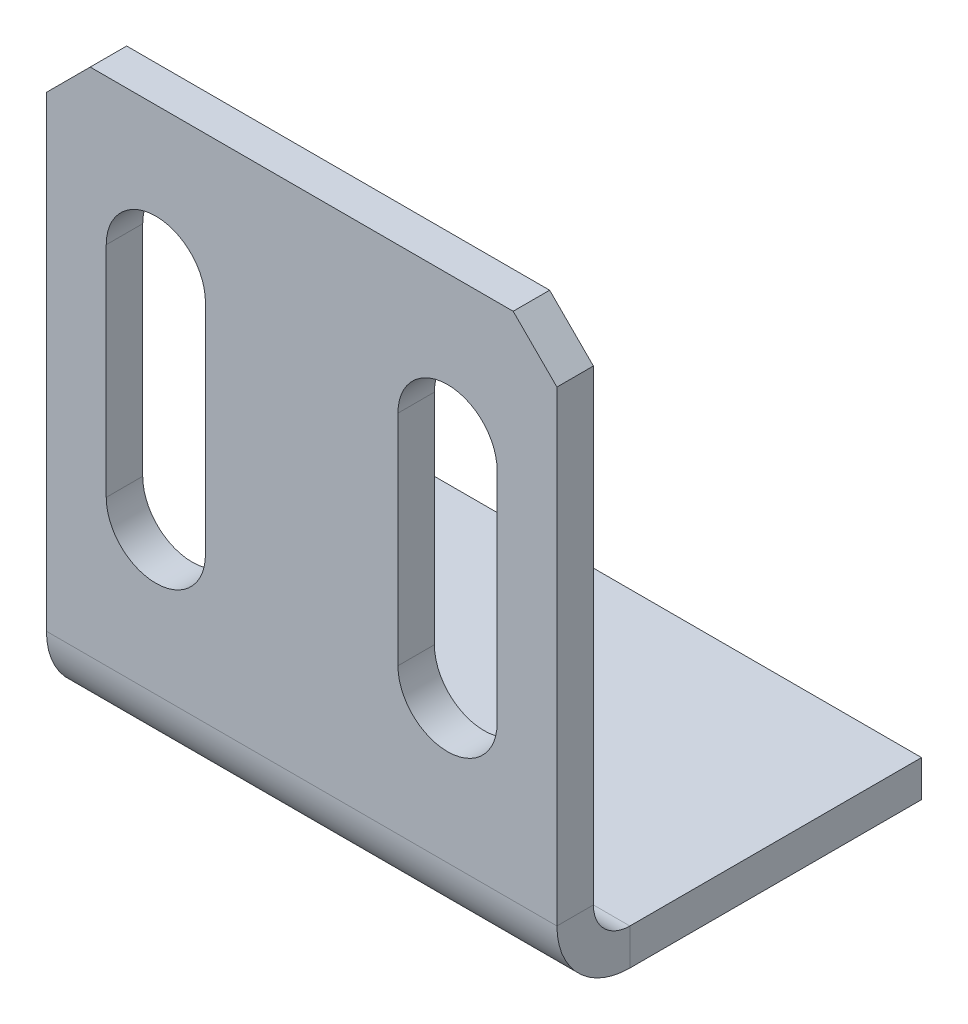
ISO-10303-21;
HEADER;
FILE_DESCRIPTION(('STEP AP214'),'2;1');
FILE_NAME('part.step','',(''),(''),'','','');
FILE_SCHEMA(('AUTOMOTIVE_DESIGN { 1 0 10303 214 1 1 1 1 }'));
ENDSEC;
DATA;
#1=APPLICATION_CONTEXT('core data for automotive mechanical design processes');
#2=APPLICATION_PROTOCOL_DEFINITION('international standard','automotive_design',2000,#1);
#3=PRODUCT_CONTEXT('',#1,'mechanical');
#4=PRODUCT('Part','Part','',(#3));
#5=PRODUCT_RELATED_PRODUCT_CATEGORY('part','',(#4));
#6=PRODUCT_DEFINITION_FORMATION('','',#4);
#7=PRODUCT_DEFINITION_CONTEXT('part definition',#1,'design');
#8=PRODUCT_DEFINITION('design','',#6,#7);
#9=PRODUCT_DEFINITION_SHAPE('','',#8);
#10=(LENGTH_UNIT() NAMED_UNIT(*) SI_UNIT(.MILLI.,.METRE.));
#11=(NAMED_UNIT(*) PLANE_ANGLE_UNIT() SI_UNIT($,.RADIAN.));
#12=(NAMED_UNIT(*) SI_UNIT($,.STERADIAN.) SOLID_ANGLE_UNIT());
#13=UNCERTAINTY_MEASURE_WITH_UNIT(LENGTH_MEASURE(1.E-05),#10,'distance_accuracy_value','');
#14=(GEOMETRIC_REPRESENTATION_CONTEXT(3) GLOBAL_UNCERTAINTY_ASSIGNED_CONTEXT((#13)) GLOBAL_UNIT_ASSIGNED_CONTEXT((#10,
#11,#12)) REPRESENTATION_CONTEXT('',''));
#15=CARTESIAN_POINT('',(0.,0.,0.));
#16=DIRECTION('',(0.,0.,1.));
#17=DIRECTION('',(1.,0.,0.));
#18=AXIS2_PLACEMENT_3D('',#15,#16,#17);
#19=CARTESIAN_POINT('',(17.5,0.,-2.5));
#20=DIRECTION('',(0.,0.,-1.));
#21=DIRECTION('',(0.,1.,0.));
#22=AXIS2_PLACEMENT_3D('',#19,#20,#21);
#23=PLANE('',#22);
#24=DIRECTION('',(-1.,0.,0.));
#25=VECTOR('',#24,1.);
#26=CARTESIAN_POINT('',(17.5,0.,-2.5));
#27=LINE('',#26,#25);
#28=CARTESIAN_POINT('',(14.5,0.,-2.5));
#29=VERTEX_POINT('',#28);
#30=CARTESIAN_POINT('',(-14.5,0.,-2.5));
#31=VERTEX_POINT('',#30);
#32=EDGE_CURVE('E326',#29,#31,#27,.T.);
#33=ORIENTED_EDGE('',*,*,#32,.F.);
#34=DIRECTION('',(-0.707106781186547,0.707106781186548,0.));
#35=VECTOR('',#34,1.);
#36=CARTESIAN_POINT('',(16.,-1.49999999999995,-2.5));
#37=LINE('',#36,#35);
#38=CARTESIAN_POINT('',(17.5,-3.,-2.5));
#39=VERTEX_POINT('',#38);
#40=EDGE_CURVE('E67',#29,#39,#37,.F.);
#41=ORIENTED_EDGE('',*,*,#40,.T.);
#42=DIRECTION('',(0.,-1.,0.));
#43=VECTOR('',#42,1.);
#44=CARTESIAN_POINT('',(17.5,0.,-2.5));
#45=LINE('',#44,#43);
#46=CARTESIAN_POINT('',(17.5,-35.,-2.5));
#47=VERTEX_POINT('',#46);
#48=EDGE_CURVE('E305',#39,#47,#45,.T.);
#49=ORIENTED_EDGE('',*,*,#48,.T.);
#50=DIRECTION('',(-1.,0.,0.));
#51=VECTOR('',#50,1.);
#52=CARTESIAN_POINT('',(17.5,-35.,-2.5));
#53=LINE('',#52,#51);
#54=CARTESIAN_POINT('',(-17.5,-35.,-2.5));
#55=VERTEX_POINT('',#54);
#56=EDGE_CURVE('E329',#47,#55,#53,.T.);
#57=ORIENTED_EDGE('',*,*,#56,.T.);
#58=DIRECTION('',(0.,-1.,0.));
#59=VECTOR('',#58,1.);
#60=CARTESIAN_POINT('',(-17.5,0.,-2.5));
#61=LINE('',#60,#59);
#62=CARTESIAN_POINT('',(-17.5,-3.,-2.5));
#63=VERTEX_POINT('',#62);
#64=EDGE_CURVE('E280',#63,#55,#61,.T.);
#65=ORIENTED_EDGE('',*,*,#64,.F.);
#66=DIRECTION('',(0.707106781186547,0.707106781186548,0.));
#67=VECTOR('',#66,1.);
#68=CARTESIAN_POINT('',(1.5,16.,-2.5));
#69=LINE('',#68,#67);
#70=EDGE_CURVE('E360',#63,#31,#69,.T.);
#71=ORIENTED_EDGE('',*,*,#70,.T.);
#72=EDGE_LOOP('',(#33,#41,#49,#57,#65,#71));
#73=FACE_BOUND('',#72,.T.);
#74=CARTESIAN_POINT('',(9.99999999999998,-25.,-2.5));
#75=DIRECTION('',(0.,0.,-1.));
#76=DIRECTION('',(0.,-1.,0.));
#77=AXIS2_PLACEMENT_3D('',#74,#75,#76);
#78=CIRCLE('',#77,3.4);
#79=CARTESIAN_POINT('',(13.4,-25.,-2.5));
#80=VERTEX_POINT('',#79);
#81=CARTESIAN_POINT('',(6.59999999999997,-25.,-2.5));
#82=VERTEX_POINT('',#81);
#83=EDGE_CURVE('E232',#80,#82,#78,.T.);
#84=ORIENTED_EDGE('',*,*,#83,.F.);
#85=DIRECTION('',(0.,-1.,0.));
#86=VECTOR('',#85,1.);
#87=CARTESIAN_POINT('',(13.4,-25.,-2.5));
#88=LINE('',#87,#86);
#89=CARTESIAN_POINT('',(13.4,-10.,-2.5));
#90=VERTEX_POINT('',#89);
#91=EDGE_CURVE('E243',#90,#80,#88,.T.);
#92=ORIENTED_EDGE('',*,*,#91,.F.);
#93=CARTESIAN_POINT('',(9.99999999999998,-10.,-2.5));
#94=DIRECTION('',(0.,0.,-1.));
#95=DIRECTION('',(0.,1.,0.));
#96=AXIS2_PLACEMENT_3D('',#93,#94,#95);
#97=CIRCLE('',#96,3.4);
#98=CARTESIAN_POINT('',(6.59999999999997,-10.,-2.5));
#99=VERTEX_POINT('',#98);
#100=EDGE_CURVE('E239',#99,#90,#97,.T.);
#101=ORIENTED_EDGE('',*,*,#100,.F.);
#102=DIRECTION('',(0.,1.,0.));
#103=VECTOR('',#102,1.);
#104=CARTESIAN_POINT('',(6.59999999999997,-25.,-2.5));
#105=LINE('',#104,#103);
#106=EDGE_CURVE('E235',#82,#99,#105,.T.);
#107=ORIENTED_EDGE('',*,*,#106,.F.);
#108=EDGE_LOOP('',(#84,#92,#101,#107));
#109=FACE_BOUND('',#108,.T.);
#110=DIRECTION('',(0.,-1.,0.));
#111=VECTOR('',#110,1.);
#112=CARTESIAN_POINT('',(-13.4,-25.,-2.5));
#113=LINE('',#112,#111);
#114=CARTESIAN_POINT('',(-13.4,-10.,-2.5));
#115=VERTEX_POINT('',#114);
#116=CARTESIAN_POINT('',(-13.4,-25.,-2.5));
#117=VERTEX_POINT('',#116);
#118=EDGE_CURVE('E200',#115,#117,#113,.T.);
#119=ORIENTED_EDGE('',*,*,#118,.T.);
#120=CARTESIAN_POINT('',(-10.,-25.,-2.5));
#121=DIRECTION('',(0.,0.,1.));
#122=DIRECTION('',(0.,-1.,0.));
#123=AXIS2_PLACEMENT_3D('',#120,#121,#122);
#124=CIRCLE('',#123,3.4);
#125=CARTESIAN_POINT('',(-6.60000000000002,-25.,-2.5));
#126=VERTEX_POINT('',#125);
#127=EDGE_CURVE('E188',#117,#126,#124,.T.);
#128=ORIENTED_EDGE('',*,*,#127,.T.);
#129=DIRECTION('',(0.,1.,0.));
#130=VECTOR('',#129,1.);
#131=CARTESIAN_POINT('',(-6.60000000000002,-25.,-2.5));
#132=LINE('',#131,#130);
#133=CARTESIAN_POINT('',(-6.60000000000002,-10.,-2.5));
#134=VERTEX_POINT('',#133);
#135=EDGE_CURVE('E190',#126,#134,#132,.T.);
#136=ORIENTED_EDGE('',*,*,#135,.T.);
#137=CARTESIAN_POINT('',(-10.,-10.,-2.5));
#138=DIRECTION('',(0.,0.,1.));
#139=DIRECTION('',(0.,1.,0.));
#140=AXIS2_PLACEMENT_3D('',#137,#138,#139);
#141=CIRCLE('',#140,3.4);
#142=EDGE_CURVE('E209',#134,#115,#141,.T.);
#143=ORIENTED_EDGE('',*,*,#142,.T.);
#144=EDGE_LOOP('',(#119,#128,#136,#143));
#145=FACE_BOUND('',#144,.T.);
#146=ADVANCED_FACE('F44',(#73,#109,#145),#23,.T.);
#147=CARTESIAN_POINT('',(17.5,0.,0.));
#148=DIRECTION('',(0.,0.,-1.));
#149=DIRECTION('',(0.,1.,0.));
#150=AXIS2_PLACEMENT_3D('',#147,#148,#149);
#151=PLANE('',#150);
#152=DIRECTION('',(0.,-1.,0.));
#153=VECTOR('',#152,1.);
#154=CARTESIAN_POINT('',(17.5,0.,0.));
#155=LINE('',#154,#153);
#156=CARTESIAN_POINT('',(17.5,-3.,0.));
#157=VERTEX_POINT('',#156);
#158=CARTESIAN_POINT('',(17.5,-35.,0.));
#159=VERTEX_POINT('',#158);
#160=EDGE_CURVE('E308',#157,#159,#155,.T.);
#161=ORIENTED_EDGE('',*,*,#160,.F.);
#162=DIRECTION('',(0.707106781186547,-0.707106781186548,0.));
#163=VECTOR('',#162,1.);
#164=CARTESIAN_POINT('',(14.5,0.,0.));
#165=LINE('',#164,#163);
#166=CARTESIAN_POINT('',(14.5,0.,0.));
#167=VERTEX_POINT('',#166);
#168=EDGE_CURVE('E11',#157,#167,#165,.F.);
#169=ORIENTED_EDGE('',*,*,#168,.T.);
#170=DIRECTION('',(-1.,0.,0.));
#171=VECTOR('',#170,1.);
#172=CARTESIAN_POINT('',(17.5,0.,0.));
#173=LINE('',#172,#171);
#174=CARTESIAN_POINT('',(-14.5,0.,0.));
#175=VERTEX_POINT('',#174);
#176=EDGE_CURVE('E323',#167,#175,#173,.T.);
#177=ORIENTED_EDGE('',*,*,#176,.T.);
#178=DIRECTION('',(-0.707106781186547,-0.707106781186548,0.));
#179=VECTOR('',#178,1.);
#180=CARTESIAN_POINT('',(-17.5,-3.,0.));
#181=LINE('',#180,#179);
#182=CARTESIAN_POINT('',(-17.5,-3.,0.));
#183=VERTEX_POINT('',#182);
#184=EDGE_CURVE('E368',#175,#183,#181,.T.);
#185=ORIENTED_EDGE('',*,*,#184,.T.);
#186=DIRECTION('',(0.,-1.,0.));
#187=VECTOR('',#186,1.);
#188=CARTESIAN_POINT('',(-17.5,0.,0.));
#189=LINE('',#188,#187);
#190=CARTESIAN_POINT('',(-17.5,-35.,0.));
#191=VERTEX_POINT('',#190);
#192=EDGE_CURVE('E283',#183,#191,#189,.T.);
#193=ORIENTED_EDGE('',*,*,#192,.T.);
#194=DIRECTION('',(-1.,0.,0.));
#195=VECTOR('',#194,1.);
#196=CARTESIAN_POINT('',(17.5,-35.,0.));
#197=LINE('',#196,#195);
#198=EDGE_CURVE('E319',#159,#191,#197,.T.);
#199=ORIENTED_EDGE('',*,*,#198,.F.);
#200=EDGE_LOOP('',(#161,#169,#177,#185,#193,#199));
#201=FACE_BOUND('',#200,.T.);
#202=DIRECTION('',(0.,1.,0.));
#203=VECTOR('',#202,1.);
#204=CARTESIAN_POINT('',(13.4,-25.,0.));
#205=LINE('',#204,#203);
#206=CARTESIAN_POINT('',(13.4,-25.,0.));
#207=VERTEX_POINT('',#206);
#208=CARTESIAN_POINT('',(13.4,-10.,0.));
#209=VERTEX_POINT('',#208);
#210=EDGE_CURVE('E224',#207,#209,#205,.T.);
#211=ORIENTED_EDGE('',*,*,#210,.F.);
#212=CARTESIAN_POINT('',(10.,-25.,0.));
#213=DIRECTION('',(0.,0.,-1.));
#214=DIRECTION('',(0.,1.,0.));
#215=AXIS2_PLACEMENT_3D('',#212,#213,#214);
#216=CIRCLE('',#215,3.4);
#217=CARTESIAN_POINT('',(6.59999999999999,-25.,0.));
#218=VERTEX_POINT('',#217);
#219=EDGE_CURVE('E228',#218,#207,#216,.F.);
#220=ORIENTED_EDGE('',*,*,#219,.F.);
#221=DIRECTION('',(0.,-1.,0.));
#222=VECTOR('',#221,1.);
#223=CARTESIAN_POINT('',(6.59999999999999,-25.,0.));
#224=LINE('',#223,#222);
#225=CARTESIAN_POINT('',(6.59999999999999,-10.,0.));
#226=VERTEX_POINT('',#225);
#227=EDGE_CURVE('E251',#226,#218,#224,.T.);
#228=ORIENTED_EDGE('',*,*,#227,.F.);
#229=CARTESIAN_POINT('',(10.,-10.,0.));
#230=DIRECTION('',(0.,0.,-1.));
#231=DIRECTION('',(0.,1.,0.));
#232=AXIS2_PLACEMENT_3D('',#229,#230,#231);
#233=CIRCLE('',#232,3.4);
#234=EDGE_CURVE('E180',#209,#226,#233,.F.);
#235=ORIENTED_EDGE('',*,*,#234,.F.);
#236=EDGE_LOOP('',(#211,#220,#228,#235));
#237=FACE_BOUND('',#236,.T.);
#238=CARTESIAN_POINT('',(-10.,-25.,0.));
#239=DIRECTION('',(0.,0.,-1.));
#240=DIRECTION('',(0.,1.,0.));
#241=AXIS2_PLACEMENT_3D('',#238,#239,#240);
#242=CIRCLE('',#241,3.4);
#243=CARTESIAN_POINT('',(-6.59999999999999,-25.,0.));
#244=VERTEX_POINT('',#243);
#245=CARTESIAN_POINT('',(-13.4,-25.,0.));
#246=VERTEX_POINT('',#245);
#247=EDGE_CURVE('E185',#244,#246,#242,.T.);
#248=ORIENTED_EDGE('',*,*,#247,.T.);
#249=DIRECTION('',(0.,1.,0.));
#250=VECTOR('',#249,1.);
#251=CARTESIAN_POINT('',(-13.4,-25.,0.));
#252=LINE('',#251,#250);
#253=CARTESIAN_POINT('',(-13.4,-10.,0.));
#254=VERTEX_POINT('',#253);
#255=EDGE_CURVE('E168',#246,#254,#252,.T.);
#256=ORIENTED_EDGE('',*,*,#255,.T.);
#257=CARTESIAN_POINT('',(-10.,-10.,0.));
#258=DIRECTION('',(0.,0.,-1.));
#259=DIRECTION('',(0.,1.,0.));
#260=AXIS2_PLACEMENT_3D('',#257,#258,#259);
#261=CIRCLE('',#260,3.4);
#262=CARTESIAN_POINT('',(-6.59999999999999,-10.,0.));
#263=VERTEX_POINT('',#262);
#264=EDGE_CURVE('E203',#254,#263,#261,.T.);
#265=ORIENTED_EDGE('',*,*,#264,.T.);
#266=DIRECTION('',(0.,-1.,0.));
#267=VECTOR('',#266,1.);
#268=CARTESIAN_POINT('',(-6.59999999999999,-25.,0.));
#269=LINE('',#268,#267);
#270=EDGE_CURVE('E194',#263,#244,#269,.T.);
#271=ORIENTED_EDGE('',*,*,#270,.T.);
#272=EDGE_LOOP('',(#248,#256,#265,#271));
#273=FACE_BOUND('',#272,.T.);
#274=ADVANCED_FACE('F193',(#201,#237,#273),#151,.F.);
#275=CARTESIAN_POINT('',(17.5,-35.,0.));
#276=DIRECTION('',(1.,0.,0.));
#277=DIRECTION('',(0.,0.,-1.));
#278=AXIS2_PLACEMENT_3D('',#275,#276,#277);
#279=PLANE('',#278);
#280=DIRECTION('',(0.,0.,-1.));
#281=VECTOR('',#280,1.);
#282=CARTESIAN_POINT('',(17.5,-35.,0.));
#283=LINE('',#282,#281);
#284=EDGE_CURVE('E352',#159,#47,#283,.T.);
#285=ORIENTED_EDGE('',*,*,#284,.F.);
#286=CARTESIAN_POINT('',(17.5,-35.,-5.));
#287=DIRECTION('',(-1.,0.,0.));
#288=DIRECTION('',(0.,0.,1.));
#289=AXIS2_PLACEMENT_3D('',#286,#287,#288);
#290=CIRCLE('',#289,5.);
#291=CARTESIAN_POINT('',(17.5,-40.,-5.));
#292=VERTEX_POINT('',#291);
#293=EDGE_CURVE('E311',#159,#292,#290,.F.);
#294=ORIENTED_EDGE('',*,*,#293,.T.);
#295=DIRECTION('',(0.,-1.,0.));
#296=VECTOR('',#295,1.);
#297=CARTESIAN_POINT('',(17.5,-37.5,-5.));
#298=LINE('',#297,#296);
#299=CARTESIAN_POINT('',(17.5,-37.5,-5.));
#300=VERTEX_POINT('',#299);
#301=EDGE_CURVE('E349',#300,#292,#298,.T.);
#302=ORIENTED_EDGE('',*,*,#301,.F.);
#303=CARTESIAN_POINT('',(17.5,-35.,-5.));
#304=DIRECTION('',(1.,0.,0.));
#305=DIRECTION('',(0.,0.,-1.));
#306=AXIS2_PLACEMENT_3D('',#303,#304,#305);
#307=CIRCLE('',#306,2.5);
#308=EDGE_CURVE('E301',#47,#300,#307,.T.);
#309=ORIENTED_EDGE('',*,*,#308,.F.);
#310=EDGE_LOOP('',(#285,#294,#302,#309));
#311=FACE_BOUND('',#310,.T.);
#312=ADVANCED_FACE('F46',(#311),#279,.T.);
#313=CARTESIAN_POINT('',(17.5,-37.5,-5.));
#314=DIRECTION('',(1.,0.,0.));
#315=DIRECTION('',(0.,0.,-1.));
#316=AXIS2_PLACEMENT_3D('',#313,#314,#315);
#317=PLANE('',#316);
#318=ORIENTED_EDGE('',*,*,#48,.F.);
#319=DIRECTION('',(0.,0.,1.));
#320=VECTOR('',#319,1.);
#321=CARTESIAN_POINT('',(17.5,-3.,-5.));
#322=LINE('',#321,#320);
#323=EDGE_CURVE('E53',#39,#157,#322,.T.);
#324=ORIENTED_EDGE('',*,*,#323,.T.);
#325=ORIENTED_EDGE('',*,*,#160,.T.);
#326=ORIENTED_EDGE('',*,*,#284,.T.);
#327=EDGE_LOOP('',(#318,#324,#325,#326));
#328=FACE_BOUND('',#327,.T.);
#329=ADVANCED_FACE('F419',(#328),#317,.T.);
#330=CARTESIAN_POINT('',(-17.5,-40.,-5.));
#331=DIRECTION('',(-1.,0.,0.));
#332=DIRECTION('',(0.,0.,1.));
#333=AXIS2_PLACEMENT_3D('',#330,#331,#332);
#334=PLANE('',#333);
#335=DIRECTION('',(0.,1.,0.));
#336=VECTOR('',#335,1.);
#337=CARTESIAN_POINT('',(-17.5,-40.,-5.));
#338=LINE('',#337,#336);
#339=CARTESIAN_POINT('',(-17.5,-40.,-5.));
#340=VERTEX_POINT('',#339);
#341=CARTESIAN_POINT('',(-17.5,-37.5,-5.));
#342=VERTEX_POINT('',#341);
#343=EDGE_CURVE('E346',#340,#342,#338,.T.);
#344=ORIENTED_EDGE('',*,*,#343,.F.);
#345=CARTESIAN_POINT('',(-17.5,-35.,-5.));
#346=DIRECTION('',(-1.,0.,0.));
#347=DIRECTION('',(0.,0.,1.));
#348=AXIS2_PLACEMENT_3D('',#345,#346,#347);
#349=CIRCLE('',#348,5.);
#350=EDGE_CURVE('E286',#191,#340,#349,.F.);
#351=ORIENTED_EDGE('',*,*,#350,.F.);
#352=DIRECTION('',(0.,0.,1.));
#353=VECTOR('',#352,1.);
#354=CARTESIAN_POINT('',(-17.5,-35.,-2.5));
#355=LINE('',#354,#353);
#356=EDGE_CURVE('E342',#55,#191,#355,.T.);
#357=ORIENTED_EDGE('',*,*,#356,.F.);
#358=CARTESIAN_POINT('',(-17.5,-35.,-5.));
#359=DIRECTION('',(1.,0.,0.));
#360=DIRECTION('',(0.,0.,-1.));
#361=AXIS2_PLACEMENT_3D('',#358,#359,#360);
#362=CIRCLE('',#361,2.5);
#363=EDGE_CURVE('E276',#55,#342,#362,.T.);
#364=ORIENTED_EDGE('',*,*,#363,.T.);
#365=EDGE_LOOP('',(#344,#351,#357,#364));
#366=FACE_BOUND('',#365,.T.);
#367=ADVANCED_FACE('F416',(#366),#334,.T.);
#368=CARTESIAN_POINT('',(-17.5,-35.,-2.5));
#369=DIRECTION('',(-1.,0.,0.));
#370=DIRECTION('',(0.,0.,1.));
#371=AXIS2_PLACEMENT_3D('',#368,#369,#370);
#372=PLANE('',#371);
#373=DIRECTION('',(0.,0.,-1.));
#374=VECTOR('',#373,1.);
#375=CARTESIAN_POINT('',(-17.5,-40.,0.));
#376=LINE('',#375,#374);
#377=CARTESIAN_POINT('',(-17.5,-40.,-25.));
#378=VERTEX_POINT('',#377);
#379=EDGE_CURVE('E264',#340,#378,#376,.T.);
#380=ORIENTED_EDGE('',*,*,#379,.F.);
#381=ORIENTED_EDGE('',*,*,#343,.T.);
#382=DIRECTION('',(0.,0.,-1.));
#383=VECTOR('',#382,1.);
#384=CARTESIAN_POINT('',(-17.5,-37.5,0.));
#385=LINE('',#384,#383);
#386=CARTESIAN_POINT('',(-17.5,-37.5,-25.));
#387=VERTEX_POINT('',#386);
#388=EDGE_CURVE('E272',#342,#387,#385,.T.);
#389=ORIENTED_EDGE('',*,*,#388,.T.);
#390=DIRECTION('',(0.,-1.,0.));
#391=VECTOR('',#390,1.);
#392=CARTESIAN_POINT('',(-17.5,-37.5,-25.));
#393=LINE('',#392,#391);
#394=EDGE_CURVE('E268',#387,#378,#393,.T.);
#395=ORIENTED_EDGE('',*,*,#394,.T.);
#396=EDGE_LOOP('',(#380,#381,#389,#395));
#397=FACE_BOUND('',#396,.T.);
#398=ADVANCED_FACE('F412',(#397),#372,.T.);
#399=CARTESIAN_POINT('',(17.5,-40.,0.));
#400=DIRECTION('',(0.,1.,0.));
#401=DIRECTION('',(0.,0.,1.));
#402=AXIS2_PLACEMENT_3D('',#399,#400,#401);
#403=PLANE('',#402);
#404=ORIENTED_EDGE('',*,*,#379,.T.);
#405=DIRECTION('',(-1.,0.,0.));
#406=VECTOR('',#405,1.);
#407=CARTESIAN_POINT('',(17.5,-40.,-25.));
#408=LINE('',#407,#406);
#409=CARTESIAN_POINT('',(17.5,-40.,-25.));
#410=VERTEX_POINT('',#409);
#411=EDGE_CURVE('E340',#410,#378,#408,.T.);
#412=ORIENTED_EDGE('',*,*,#411,.F.);
#413=DIRECTION('',(0.,0.,-1.));
#414=VECTOR('',#413,1.);
#415=CARTESIAN_POINT('',(17.5,-40.,0.));
#416=LINE('',#415,#414);
#417=EDGE_CURVE('E290',#292,#410,#416,.T.);
#418=ORIENTED_EDGE('',*,*,#417,.F.);
#419=DIRECTION('',(-1.,0.,0.));
#420=VECTOR('',#419,1.);
#421=CARTESIAN_POINT('',(17.5,-40.,-5.));
#422=LINE('',#421,#420);
#423=EDGE_CURVE('E315',#292,#340,#422,.T.);
#424=ORIENTED_EDGE('',*,*,#423,.T.);
#425=EDGE_LOOP('',(#404,#412,#418,#424));
#426=FACE_BOUND('',#425,.T.);
#427=ADVANCED_FACE('F408',(#426),#403,.F.);
#428=CARTESIAN_POINT('',(17.5,-37.5,-25.));
#429=DIRECTION('',(0.,0.,-1.));
#430=DIRECTION('',(-1.,0.,0.));
#431=AXIS2_PLACEMENT_3D('',#428,#429,#430);
#432=PLANE('',#431);
#433=ORIENTED_EDGE('',*,*,#394,.F.);
#434=DIRECTION('',(-1.,0.,0.));
#435=VECTOR('',#434,1.);
#436=CARTESIAN_POINT('',(17.5,-37.5,-25.));
#437=LINE('',#436,#435);
#438=CARTESIAN_POINT('',(17.5,-37.5,-25.));
#439=VERTEX_POINT('',#438);
#440=EDGE_CURVE('E337',#439,#387,#437,.T.);
#441=ORIENTED_EDGE('',*,*,#440,.F.);
#442=DIRECTION('',(0.,-1.,0.));
#443=VECTOR('',#442,1.);
#444=CARTESIAN_POINT('',(17.5,-37.5,-25.));
#445=LINE('',#444,#443);
#446=EDGE_CURVE('E293',#439,#410,#445,.T.);
#447=ORIENTED_EDGE('',*,*,#446,.T.);
#448=ORIENTED_EDGE('',*,*,#411,.T.);
#449=EDGE_LOOP('',(#433,#441,#447,#448));
#450=FACE_BOUND('',#449,.T.);
#451=ADVANCED_FACE('F404',(#450),#432,.T.);
#452=CARTESIAN_POINT('',(17.5,-37.5,0.));
#453=DIRECTION('',(0.,1.,0.));
#454=DIRECTION('',(0.,0.,1.));
#455=AXIS2_PLACEMENT_3D('',#452,#453,#454);
#456=PLANE('',#455);
#457=ORIENTED_EDGE('',*,*,#388,.F.);
#458=DIRECTION('',(-1.,0.,0.));
#459=VECTOR('',#458,1.);
#460=CARTESIAN_POINT('',(17.5,-37.5,-5.));
#461=LINE('',#460,#459);
#462=EDGE_CURVE('E333',#300,#342,#461,.T.);
#463=ORIENTED_EDGE('',*,*,#462,.F.);
#464=DIRECTION('',(0.,0.,-1.));
#465=VECTOR('',#464,1.);
#466=CARTESIAN_POINT('',(17.5,-37.5,0.));
#467=LINE('',#466,#465);
#468=EDGE_CURVE('E297',#300,#439,#467,.T.);
#469=ORIENTED_EDGE('',*,*,#468,.T.);
#470=ORIENTED_EDGE('',*,*,#440,.T.);
#471=EDGE_LOOP('',(#457,#463,#469,#470));
#472=FACE_BOUND('',#471,.T.);
#473=ADVANCED_FACE('F400',(#472),#456,.T.);
#474=CARTESIAN_POINT('',(17.5,-35.,-5.));
#475=DIRECTION('',(-1.,0.,0.));
#476=DIRECTION('',(0.,0.,1.));
#477=AXIS2_PLACEMENT_3D('',#474,#475,#476);
#478=CYLINDRICAL_SURFACE('',#477,2.5);
#479=ORIENTED_EDGE('',*,*,#363,.F.);
#480=ORIENTED_EDGE('',*,*,#56,.F.);
#481=ORIENTED_EDGE('',*,*,#308,.T.);
#482=ORIENTED_EDGE('',*,*,#462,.T.);
#483=EDGE_LOOP('',(#479,#480,#481,#482));
#484=FACE_BOUND('',#483,.T.);
#485=ADVANCED_FACE('F397',(#484),#478,.F.);
#486=CARTESIAN_POINT('',(17.5,0.,0.));
#487=DIRECTION('',(0.,1.,0.));
#488=DIRECTION('',(0.,0.,1.));
#489=AXIS2_PLACEMENT_3D('',#486,#487,#488);
#490=PLANE('',#489);
#491=ORIENTED_EDGE('',*,*,#176,.F.);
#492=DIRECTION('',(0.,0.,-1.));
#493=VECTOR('',#492,1.);
#494=CARTESIAN_POINT('',(14.5,0.,0.));
#495=LINE('',#494,#493);
#496=EDGE_CURVE('E371',#167,#29,#495,.T.);
#497=ORIENTED_EDGE('',*,*,#496,.T.);
#498=ORIENTED_EDGE('',*,*,#32,.T.);
#499=DIRECTION('',(0.,0.,1.));
#500=VECTOR('',#499,1.);
#501=CARTESIAN_POINT('',(-14.5,0.,0.));
#502=LINE('',#501,#500);
#503=EDGE_CURVE('E364',#31,#175,#502,.T.);
#504=ORIENTED_EDGE('',*,*,#503,.T.);
#505=EDGE_LOOP('',(#491,#497,#498,#504));
#506=FACE_BOUND('',#505,.T.);
#507=ADVANCED_FACE('F396',(#506),#490,.T.);
#508=CARTESIAN_POINT('',(17.5,-35.,-5.));
#509=DIRECTION('',(-1.,0.,0.));
#510=DIRECTION('',(0.,0.,1.));
#511=AXIS2_PLACEMENT_3D('',#508,#509,#510);
#512=CYLINDRICAL_SURFACE('',#511,5.);
#513=ORIENTED_EDGE('',*,*,#350,.T.);
#514=ORIENTED_EDGE('',*,*,#423,.F.);
#515=ORIENTED_EDGE('',*,*,#293,.F.);
#516=ORIENTED_EDGE('',*,*,#198,.T.);
#517=EDGE_LOOP('',(#513,#514,#515,#516));
#518=FACE_BOUND('',#517,.T.);
#519=ADVANCED_FACE('F449',(#518),#512,.T.);
#520=CARTESIAN_POINT('',(17.5,-35.,-5.));
#521=DIRECTION('',(1.,0.,0.));
#522=DIRECTION('',(0.,0.,-1.));
#523=AXIS2_PLACEMENT_3D('',#520,#521,#522);
#524=PLANE('',#523);
#525=ORIENTED_EDGE('',*,*,#417,.T.);
#526=ORIENTED_EDGE('',*,*,#446,.F.);
#527=ORIENTED_EDGE('',*,*,#468,.F.);
#528=ORIENTED_EDGE('',*,*,#301,.T.);
#529=EDGE_LOOP('',(#525,#526,#527,#528));
#530=FACE_BOUND('',#529,.T.);
#531=ADVANCED_FACE('F462',(#530),#524,.T.);
#532=CARTESIAN_POINT('',(-17.5,-35.,-5.));
#533=DIRECTION('',(1.,0.,0.));
#534=DIRECTION('',(0.,0.,-1.));
#535=AXIS2_PLACEMENT_3D('',#532,#533,#534);
#536=PLANE('',#535);
#537=ORIENTED_EDGE('',*,*,#192,.F.);
#538=DIRECTION('',(0.,0.,-1.));
#539=VECTOR('',#538,1.);
#540=CARTESIAN_POINT('',(-17.5,-3.,-2.5));
#541=LINE('',#540,#539);
#542=EDGE_CURVE('E356',#183,#63,#541,.T.);
#543=ORIENTED_EDGE('',*,*,#542,.T.);
#544=ORIENTED_EDGE('',*,*,#64,.T.);
#545=ORIENTED_EDGE('',*,*,#356,.T.);
#546=EDGE_LOOP('',(#537,#543,#544,#545));
#547=FACE_BOUND('',#546,.T.);
#548=ADVANCED_FACE('F443',(#547),#536,.F.);
#549=CARTESIAN_POINT('',(10.,-25.,0.001000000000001));
#550=DIRECTION('',(0.,0.,-1.));
#551=DIRECTION('',(0.,1.,0.));
#552=AXIS2_PLACEMENT_3D('',#549,#550,#551);
#553=CYLINDRICAL_SURFACE('',#552,3.4);
#554=ORIENTED_EDGE('',*,*,#219,.T.);
#555=DIRECTION('',(0.,0.,-1.));
#556=VECTOR('',#555,1.);
#557=CARTESIAN_POINT('',(13.4,-25.,0.001000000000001));
#558=LINE('',#557,#556);
#559=EDGE_CURVE('E248',#207,#80,#558,.T.);
#560=ORIENTED_EDGE('',*,*,#559,.T.);
#561=ORIENTED_EDGE('',*,*,#83,.T.);
#562=DIRECTION('',(0.,0.,-1.));
#563=VECTOR('',#562,1.);
#564=CARTESIAN_POINT('',(6.59999999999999,-25.,0.001000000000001));
#565=LINE('',#564,#563);
#566=EDGE_CURVE('E247',#218,#82,#565,.T.);
#567=ORIENTED_EDGE('',*,*,#566,.F.);
#568=EDGE_LOOP('',(#554,#560,#561,#567));
#569=FACE_BOUND('',#568,.T.);
#570=ADVANCED_FACE('F469',(#569),#553,.F.);
#571=CARTESIAN_POINT('',(13.4,-25.,0.001000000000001));
#572=DIRECTION('',(1.,0.,0.));
#573=DIRECTION('',(0.,0.,-1.));
#574=AXIS2_PLACEMENT_3D('',#571,#572,#573);
#575=PLANE('',#574);
#576=ORIENTED_EDGE('',*,*,#210,.T.);
#577=DIRECTION('',(0.,0.,-1.));
#578=VECTOR('',#577,1.);
#579=CARTESIAN_POINT('',(13.4,-10.,0.001000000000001));
#580=LINE('',#579,#578);
#581=EDGE_CURVE('E252',#209,#90,#580,.T.);
#582=ORIENTED_EDGE('',*,*,#581,.T.);
#583=ORIENTED_EDGE('',*,*,#91,.T.);
#584=ORIENTED_EDGE('',*,*,#559,.F.);
#585=EDGE_LOOP('',(#576,#582,#583,#584));
#586=FACE_BOUND('',#585,.T.);
#587=ADVANCED_FACE('F475',(#586),#575,.F.);
#588=CARTESIAN_POINT('',(10.,-10.,0.001000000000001));
#589=DIRECTION('',(0.,0.,-1.));
#590=DIRECTION('',(0.,1.,0.));
#591=AXIS2_PLACEMENT_3D('',#588,#589,#590);
#592=CYLINDRICAL_SURFACE('',#591,3.4);
#593=ORIENTED_EDGE('',*,*,#234,.T.);
#594=DIRECTION('',(0.,0.,-1.));
#595=VECTOR('',#594,1.);
#596=CARTESIAN_POINT('',(6.59999999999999,-10.,0.001000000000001));
#597=LINE('',#596,#595);
#598=EDGE_CURVE('E255',#226,#99,#597,.T.);
#599=ORIENTED_EDGE('',*,*,#598,.T.);
#600=ORIENTED_EDGE('',*,*,#100,.T.);
#601=ORIENTED_EDGE('',*,*,#581,.F.);
#602=EDGE_LOOP('',(#593,#599,#600,#601));
#603=FACE_BOUND('',#602,.T.);
#604=ADVANCED_FACE('F480',(#603),#592,.F.);
#605=CARTESIAN_POINT('',(6.59999999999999,-25.,0.001000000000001));
#606=DIRECTION('',(-1.,0.,0.));
#607=DIRECTION('',(0.,0.,1.));
#608=AXIS2_PLACEMENT_3D('',#605,#606,#607);
#609=PLANE('',#608);
#610=ORIENTED_EDGE('',*,*,#227,.T.);
#611=ORIENTED_EDGE('',*,*,#566,.T.);
#612=ORIENTED_EDGE('',*,*,#106,.T.);
#613=ORIENTED_EDGE('',*,*,#598,.F.);
#614=EDGE_LOOP('',(#610,#611,#612,#613));
#615=FACE_BOUND('',#614,.T.);
#616=ADVANCED_FACE('F477',(#615),#609,.F.);
#617=CARTESIAN_POINT('',(-10.,-25.,0.001000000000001));
#618=DIRECTION('',(0.,0.,-1.));
#619=DIRECTION('',(0.,1.,0.));
#620=AXIS2_PLACEMENT_3D('',#617,#618,#619);
#621=CYLINDRICAL_SURFACE('',#620,3.4);
#622=DIRECTION('',(0.,0.,-1.));
#623=VECTOR('',#622,1.);
#624=CARTESIAN_POINT('',(-6.59999999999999,-25.,0.001000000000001));
#625=LINE('',#624,#623);
#626=EDGE_CURVE('E181',#244,#126,#625,.T.);
#627=ORIENTED_EDGE('',*,*,#626,.T.);
#628=ORIENTED_EDGE('',*,*,#127,.F.);
#629=DIRECTION('',(0.,0.,-1.));
#630=VECTOR('',#629,1.);
#631=CARTESIAN_POINT('',(-13.4,-25.,0.001000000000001));
#632=LINE('',#631,#630);
#633=EDGE_CURVE('E172',#246,#117,#632,.T.);
#634=ORIENTED_EDGE('',*,*,#633,.F.);
#635=ORIENTED_EDGE('',*,*,#247,.F.);
#636=EDGE_LOOP('',(#627,#628,#634,#635));
#637=FACE_BOUND('',#636,.T.);
#638=ADVANCED_FACE('F184',(#637),#621,.F.);
#639=CARTESIAN_POINT('',(-6.59999999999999,-25.,0.001000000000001));
#640=DIRECTION('',(-1.,0.,0.));
#641=DIRECTION('',(0.,0.,1.));
#642=AXIS2_PLACEMENT_3D('',#639,#640,#641);
#643=PLANE('',#642);
#644=DIRECTION('',(0.,0.,-1.));
#645=VECTOR('',#644,1.);
#646=CARTESIAN_POINT('',(-6.59999999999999,-10.,0.001000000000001));
#647=LINE('',#646,#645);
#648=EDGE_CURVE('E217',#263,#134,#647,.T.);
#649=ORIENTED_EDGE('',*,*,#648,.T.);
#650=ORIENTED_EDGE('',*,*,#135,.F.);
#651=ORIENTED_EDGE('',*,*,#626,.F.);
#652=ORIENTED_EDGE('',*,*,#270,.F.);
#653=EDGE_LOOP('',(#649,#650,#651,#652));
#654=FACE_BOUND('',#653,.T.);
#655=ADVANCED_FACE('F384',(#654),#643,.T.);
#656=CARTESIAN_POINT('',(-10.,-10.,0.001000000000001));
#657=DIRECTION('',(0.,0.,-1.));
#658=DIRECTION('',(0.,1.,0.));
#659=AXIS2_PLACEMENT_3D('',#656,#657,#658);
#660=CYLINDRICAL_SURFACE('',#659,3.4);
#661=DIRECTION('',(0.,0.,-1.));
#662=VECTOR('',#661,1.);
#663=CARTESIAN_POINT('',(-13.4,-10.,0.001000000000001));
#664=LINE('',#663,#662);
#665=EDGE_CURVE('E174',#254,#115,#664,.T.);
#666=ORIENTED_EDGE('',*,*,#665,.T.);
#667=ORIENTED_EDGE('',*,*,#142,.F.);
#668=ORIENTED_EDGE('',*,*,#648,.F.);
#669=ORIENTED_EDGE('',*,*,#264,.F.);
#670=EDGE_LOOP('',(#666,#667,#668,#669));
#671=FACE_BOUND('',#670,.T.);
#672=ADVANCED_FACE('F380',(#671),#660,.F.);
#673=CARTESIAN_POINT('',(-13.4,-25.,0.001000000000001));
#674=DIRECTION('',(1.,0.,0.));
#675=DIRECTION('',(0.,0.,-1.));
#676=AXIS2_PLACEMENT_3D('',#673,#674,#675);
#677=PLANE('',#676);
#678=ORIENTED_EDGE('',*,*,#633,.T.);
#679=ORIENTED_EDGE('',*,*,#118,.F.);
#680=ORIENTED_EDGE('',*,*,#665,.F.);
#681=ORIENTED_EDGE('',*,*,#255,.F.);
#682=EDGE_LOOP('',(#678,#679,#680,#681));
#683=FACE_BOUND('',#682,.T.);
#684=ADVANCED_FACE('F170',(#683),#677,.T.);
#685=CARTESIAN_POINT('',(-17.5,-3.,-5.));
#686=DIRECTION('',(-0.707106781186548,0.707106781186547,0.));
#687=DIRECTION('',(-0.707106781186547,-0.707106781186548,0.));
#688=AXIS2_PLACEMENT_3D('',#685,#686,#687);
#689=PLANE('',#688);
#690=ORIENTED_EDGE('',*,*,#184,.F.);
#691=ORIENTED_EDGE('',*,*,#503,.F.);
#692=ORIENTED_EDGE('',*,*,#70,.F.);
#693=ORIENTED_EDGE('',*,*,#542,.F.);
#694=EDGE_LOOP('',(#690,#691,#692,#693));
#695=FACE_BOUND('',#694,.T.);
#696=ADVANCED_FACE('F440',(#695),#689,.T.);
#697=CARTESIAN_POINT('',(14.5,0.,0.));
#698=DIRECTION('',(-0.707106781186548,-0.707106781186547,0.));
#699=DIRECTION('',(0.707106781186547,-0.707106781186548,0.));
#700=AXIS2_PLACEMENT_3D('',#697,#698,#699);
#701=PLANE('',#700);
#702=ORIENTED_EDGE('',*,*,#168,.F.);
#703=ORIENTED_EDGE('',*,*,#323,.F.);
#704=ORIENTED_EDGE('',*,*,#40,.F.);
#705=ORIENTED_EDGE('',*,*,#496,.F.);
#706=EDGE_LOOP('',(#702,#703,#704,#705));
#707=FACE_BOUND('',#706,.T.);
#708=ADVANCED_FACE('F430',(#707),#701,.F.);
#709=CLOSED_SHELL('',(#146,#274,#312,#329,#367,#398,#427,#451,#473,#485,#507,#519,#531,#548,
#570,#587,#604,#616,#638,#655,#672,#684,#696,#708));
#710=MANIFOLD_SOLID_BREP('B2',#709);
#711=ADVANCED_BREP_SHAPE_REPRESENTATION('',(#18,#710),#14);
#712=SHAPE_DEFINITION_REPRESENTATION(#9,#711);
ENDSEC;
END-ISO-10303-21;
